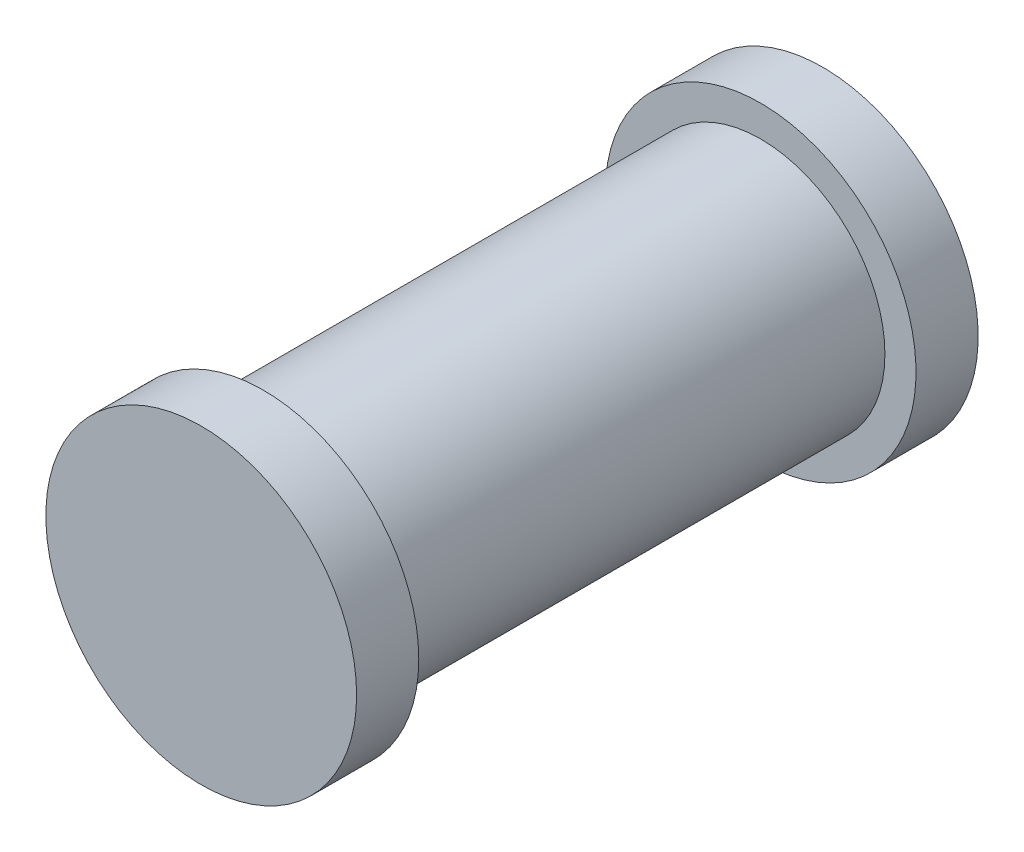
ISO-10303-21;
HEADER;
FILE_DESCRIPTION(('STEP AP214'),'2;1');
FILE_NAME('part.step','',(''),(''),'','','');
FILE_SCHEMA(('AUTOMOTIVE_DESIGN { 1 0 10303 214 1 1 1 1 }'));
ENDSEC;
DATA;
#1=APPLICATION_CONTEXT('core data for automotive mechanical design processes');
#2=APPLICATION_PROTOCOL_DEFINITION('international standard','automotive_design',2000,#1);
#3=PRODUCT_CONTEXT('',#1,'mechanical');
#4=PRODUCT('Part','Part','',(#3));
#5=PRODUCT_RELATED_PRODUCT_CATEGORY('part','',(#4));
#6=PRODUCT_DEFINITION_FORMATION('','',#4);
#7=PRODUCT_DEFINITION_CONTEXT('part definition',#1,'design');
#8=PRODUCT_DEFINITION('design','',#6,#7);
#9=PRODUCT_DEFINITION_SHAPE('','',#8);
#10=(LENGTH_UNIT() NAMED_UNIT(*) SI_UNIT(.MILLI.,.METRE.));
#11=(NAMED_UNIT(*) PLANE_ANGLE_UNIT() SI_UNIT($,.RADIAN.));
#12=(NAMED_UNIT(*) SI_UNIT($,.STERADIAN.) SOLID_ANGLE_UNIT());
#13=UNCERTAINTY_MEASURE_WITH_UNIT(LENGTH_MEASURE(1.E-05),#10,'distance_accuracy_value','');
#14=(GEOMETRIC_REPRESENTATION_CONTEXT(3) GLOBAL_UNCERTAINTY_ASSIGNED_CONTEXT((#13)) GLOBAL_UNIT_ASSIGNED_CONTEXT((#10,
#11,#12)) REPRESENTATION_CONTEXT('',''));
#15=CARTESIAN_POINT('',(0.,0.,0.));
#16=DIRECTION('',(0.,0.,1.));
#17=DIRECTION('',(1.,0.,0.));
#18=AXIS2_PLACEMENT_3D('',#15,#16,#17);
#19=CARTESIAN_POINT('',(0.,0.,-25.4));
#20=DIRECTION('',(0.,0.,1.));
#21=DIRECTION('',(1.,0.,0.));
#22=AXIS2_PLACEMENT_3D('',#19,#20,#21);
#23=CYLINDRICAL_SURFACE('',#22,6.35);
#24=CARTESIAN_POINT('',(0.,0.,-25.4));
#25=DIRECTION('',(0.,0.,-1.));
#26=DIRECTION('',(-1.,0.,0.));
#27=AXIS2_PLACEMENT_3D('',#24,#25,#26);
#28=CIRCLE('',#27,6.35);
#29=CARTESIAN_POINT('',(-6.35,0.,-25.4));
#30=VERTEX_POINT('',#29);
#31=EDGE_CURVE('E53',#30,#30,#28,.F.);
#32=ORIENTED_EDGE('',*,*,#31,.T.);
#33=EDGE_LOOP('',(#32));
#34=FACE_BOUND('',#33,.T.);
#35=CARTESIAN_POINT('',(0.,0.,0.));
#36=DIRECTION('',(0.,0.,1.));
#37=DIRECTION('',(1.,0.,0.));
#38=AXIS2_PLACEMENT_3D('',#35,#36,#37);
#39=CIRCLE('',#38,6.35);
#40=CARTESIAN_POINT('',(6.35,0.,0.));
#41=VERTEX_POINT('',#40);
#42=EDGE_CURVE('E10',#41,#41,#39,.T.);
#43=ORIENTED_EDGE('',*,*,#42,.F.);
#44=EDGE_LOOP('',(#43));
#45=FACE_BOUND('',#44,.T.);
#46=ADVANCED_FACE('F39',(#34,#45),#23,.T.);
#47=CARTESIAN_POINT('',(0.,0.,3.175));
#48=DIRECTION('',(0.,0.,-1.));
#49=DIRECTION('',(-1.,0.,0.));
#50=AXIS2_PLACEMENT_3D('',#47,#48,#49);
#51=CYLINDRICAL_SURFACE('',#50,7.9375);
#52=CARTESIAN_POINT('',(0.,0.,3.175));
#53=DIRECTION('',(0.,0.,1.));
#54=DIRECTION('',(1.,0.,0.));
#55=AXIS2_PLACEMENT_3D('',#52,#53,#54);
#56=CIRCLE('',#55,7.9375);
#57=CARTESIAN_POINT('',(7.9375,0.,3.175));
#58=VERTEX_POINT('',#57);
#59=EDGE_CURVE('E44',#58,#58,#56,.T.);
#60=ORIENTED_EDGE('',*,*,#59,.F.);
#61=EDGE_LOOP('',(#60));
#62=FACE_BOUND('',#61,.T.);
#63=CARTESIAN_POINT('',(0.,0.,0.));
#64=DIRECTION('',(0.,0.,1.));
#65=DIRECTION('',(1.,0.,0.));
#66=AXIS2_PLACEMENT_3D('',#63,#64,#65);
#67=CIRCLE('',#66,7.9375);
#68=CARTESIAN_POINT('',(7.9375,0.,0.));
#69=VERTEX_POINT('',#68);
#70=EDGE_CURVE('E47',#69,#69,#67,.T.);
#71=ORIENTED_EDGE('',*,*,#70,.T.);
#72=EDGE_LOOP('',(#71));
#73=FACE_BOUND('',#72,.T.);
#74=ADVANCED_FACE('F81',(#62,#73),#51,.T.);
#75=CARTESIAN_POINT('',(0.,0.,3.175));
#76=DIRECTION('',(0.,0.,1.));
#77=DIRECTION('',(1.,0.,0.));
#78=AXIS2_PLACEMENT_3D('',#75,#76,#77);
#79=PLANE('',#78);
#80=ORIENTED_EDGE('',*,*,#59,.T.);
#81=EDGE_LOOP('',(#80));
#82=FACE_BOUND('',#81,.T.);
#83=ADVANCED_FACE('F86',(#82),#79,.T.);
#84=CARTESIAN_POINT('',(0.,0.,0.));
#85=DIRECTION('',(0.,0.,1.));
#86=DIRECTION('',(1.,0.,0.));
#87=AXIS2_PLACEMENT_3D('',#84,#85,#86);
#88=PLANE('',#87);
#89=ORIENTED_EDGE('',*,*,#42,.T.);
#90=EDGE_LOOP('',(#89));
#91=FACE_BOUND('',#90,.T.);
#92=ORIENTED_EDGE('',*,*,#70,.F.);
#93=EDGE_LOOP('',(#92));
#94=FACE_BOUND('',#93,.T.);
#95=ADVANCED_FACE('F68',(#91,#94),#88,.F.);
#96=CARTESIAN_POINT('',(0.,0.,-28.575));
#97=DIRECTION('',(0.,0.,1.));
#98=DIRECTION('',(1.,0.,0.));
#99=AXIS2_PLACEMENT_3D('',#96,#97,#98);
#100=CYLINDRICAL_SURFACE('',#99,7.9375);
#101=CARTESIAN_POINT('',(0.,0.,-28.575));
#102=DIRECTION('',(0.,0.,-1.));
#103=DIRECTION('',(-1.,0.,0.));
#104=AXIS2_PLACEMENT_3D('',#101,#102,#103);
#105=CIRCLE('',#104,7.9375);
#106=CARTESIAN_POINT('',(-7.9375,0.,-28.575));
#107=VERTEX_POINT('',#106);
#108=EDGE_CURVE('E59',#107,#107,#105,.T.);
#109=ORIENTED_EDGE('',*,*,#108,.F.);
#110=EDGE_LOOP('',(#109));
#111=FACE_BOUND('',#110,.T.);
#112=CARTESIAN_POINT('',(0.,0.,-25.4));
#113=DIRECTION('',(0.,0.,-1.));
#114=DIRECTION('',(-1.,0.,0.));
#115=AXIS2_PLACEMENT_3D('',#112,#113,#114);
#116=CIRCLE('',#115,7.9375);
#117=CARTESIAN_POINT('',(-7.9375,0.,-25.4));
#118=VERTEX_POINT('',#117);
#119=EDGE_CURVE('E56',#118,#118,#116,.T.);
#120=ORIENTED_EDGE('',*,*,#119,.T.);
#121=EDGE_LOOP('',(#120));
#122=FACE_BOUND('',#121,.T.);
#123=ADVANCED_FACE('F70',(#111,#122),#100,.T.);
#124=CARTESIAN_POINT('',(0.,0.,-28.575));
#125=DIRECTION('',(0.,0.,-1.));
#126=DIRECTION('',(-1.,0.,0.));
#127=AXIS2_PLACEMENT_3D('',#124,#125,#126);
#128=PLANE('',#127);
#129=ORIENTED_EDGE('',*,*,#108,.T.);
#130=EDGE_LOOP('',(#129));
#131=FACE_BOUND('',#130,.T.);
#132=ADVANCED_FACE('F63',(#131),#128,.T.);
#133=CARTESIAN_POINT('',(0.,0.,-25.4));
#134=DIRECTION('',(0.,0.,-1.));
#135=DIRECTION('',(-1.,0.,0.));
#136=AXIS2_PLACEMENT_3D('',#133,#134,#135);
#137=PLANE('',#136);
#138=ORIENTED_EDGE('',*,*,#31,.F.);
#139=EDGE_LOOP('',(#138));
#140=FACE_BOUND('',#139,.T.);
#141=ORIENTED_EDGE('',*,*,#119,.F.);
#142=EDGE_LOOP('',(#141));
#143=FACE_BOUND('',#142,.T.);
#144=ADVANCED_FACE('F74',(#140,#143),#137,.F.);
#145=CLOSED_SHELL('',(#46,#74,#83,#95,#123,#132,#144));
#146=MANIFOLD_SOLID_BREP('B2',#145);
#147=ADVANCED_BREP_SHAPE_REPRESENTATION('',(#18,#146),#14);
#148=SHAPE_DEFINITION_REPRESENTATION(#9,#147);
ENDSEC;
END-ISO-10303-21;
